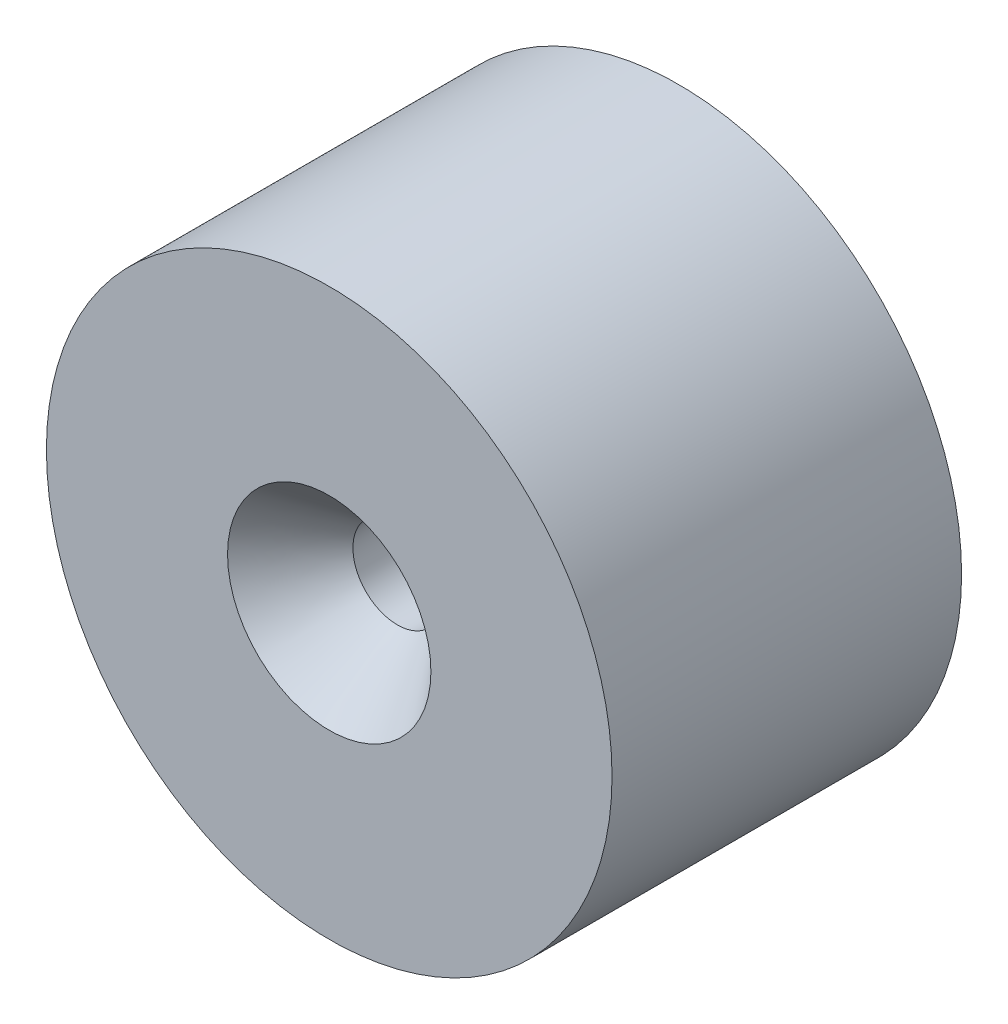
ISO-10303-21;
HEADER;
FILE_DESCRIPTION(('STEP AP214'),'2;1');
FILE_NAME('part.step','',(''),(''),'','','');
FILE_SCHEMA(('AUTOMOTIVE_DESIGN { 1 0 10303 214 1 1 1 1 }'));
ENDSEC;
DATA;
#1=APPLICATION_CONTEXT('core data for automotive mechanical design processes');
#2=APPLICATION_PROTOCOL_DEFINITION('international standard','automotive_design',2000,#1);
#3=PRODUCT_CONTEXT('',#1,'mechanical');
#4=PRODUCT('Part','Part','',(#3));
#5=PRODUCT_RELATED_PRODUCT_CATEGORY('part','',(#4));
#6=PRODUCT_DEFINITION_FORMATION('','',#4);
#7=PRODUCT_DEFINITION_CONTEXT('part definition',#1,'design');
#8=PRODUCT_DEFINITION('design','',#6,#7);
#9=PRODUCT_DEFINITION_SHAPE('','',#8);
#10=(LENGTH_UNIT() NAMED_UNIT(*) SI_UNIT(.MILLI.,.METRE.));
#11=(NAMED_UNIT(*) PLANE_ANGLE_UNIT() SI_UNIT($,.RADIAN.));
#12=(NAMED_UNIT(*) SI_UNIT($,.STERADIAN.) SOLID_ANGLE_UNIT());
#13=UNCERTAINTY_MEASURE_WITH_UNIT(LENGTH_MEASURE(1.E-05),#10,'distance_accuracy_value','');
#14=(GEOMETRIC_REPRESENTATION_CONTEXT(3) GLOBAL_UNCERTAINTY_ASSIGNED_CONTEXT((#13)) GLOBAL_UNIT_ASSIGNED_CONTEXT((#10,
#11,#12)) REPRESENTATION_CONTEXT('',''));
#15=CARTESIAN_POINT('',(0.,0.,0.));
#16=DIRECTION('',(0.,0.,1.));
#17=DIRECTION('',(1.,0.,0.));
#18=AXIS2_PLACEMENT_3D('',#15,#16,#17);
#19=CARTESIAN_POINT('',(0.,0.,11.));
#20=DIRECTION('',(0.,0.,1.));
#21=DIRECTION('',(1.,0.,0.));
#22=AXIS2_PLACEMENT_3D('',#19,#20,#21);
#23=PLANE('',#22);
#24=CARTESIAN_POINT('',(0.,0.,11.));
#25=DIRECTION('',(0.,0.,1.));
#26=DIRECTION('',(1.,0.,0.));
#27=AXIS2_PLACEMENT_3D('',#24,#25,#26);
#28=CIRCLE('',#27,3.2);
#29=CARTESIAN_POINT('',(3.2,0.,11.));
#30=VERTEX_POINT('',#29);
#31=EDGE_CURVE('E70',#30,#30,#28,.T.);
#32=ORIENTED_EDGE('',*,*,#31,.F.);
#33=EDGE_LOOP('',(#32));
#34=FACE_BOUND('',#33,.T.);
#35=CARTESIAN_POINT('',(0.,0.,11.));
#36=DIRECTION('',(0.,0.,1.));
#37=DIRECTION('',(1.,0.,0.));
#38=AXIS2_PLACEMENT_3D('',#35,#36,#37);
#39=CIRCLE('',#38,8.9);
#40=CARTESIAN_POINT('',(8.9,0.,11.));
#41=VERTEX_POINT('',#40);
#42=EDGE_CURVE('E11',#41,#41,#39,.T.);
#43=ORIENTED_EDGE('',*,*,#42,.T.);
#44=EDGE_LOOP('',(#43));
#45=FACE_BOUND('',#44,.T.);
#46=ADVANCED_FACE('F40',(#34,#45),#23,.T.);
#47=CARTESIAN_POINT('',(0.,0.,0.));
#48=DIRECTION('',(0.,0.,1.));
#49=DIRECTION('',(1.,0.,0.));
#50=AXIS2_PLACEMENT_3D('',#47,#48,#49);
#51=PLANE('',#50);
#52=CARTESIAN_POINT('',(0.,0.,0.));
#53=DIRECTION('',(0.,0.,1.));
#54=DIRECTION('',(1.,0.,0.));
#55=AXIS2_PLACEMENT_3D('',#52,#53,#54);
#56=CIRCLE('',#55,8.9);
#57=CARTESIAN_POINT('',(8.9,0.,0.));
#58=VERTEX_POINT('',#57);
#59=EDGE_CURVE('E44',#58,#58,#56,.T.);
#60=ORIENTED_EDGE('',*,*,#59,.F.);
#61=EDGE_LOOP('',(#60));
#62=FACE_BOUND('',#61,.T.);
#63=CARTESIAN_POINT('',(0.,0.,0.));
#64=DIRECTION('',(0.,0.,1.));
#65=DIRECTION('',(1.,0.,0.));
#66=AXIS2_PLACEMENT_3D('',#63,#64,#65);
#67=CIRCLE('',#66,1.4);
#68=CARTESIAN_POINT('',(1.4,0.,0.));
#69=VERTEX_POINT('',#68);
#70=EDGE_CURVE('E51',#69,#69,#67,.T.);
#71=ORIENTED_EDGE('',*,*,#70,.T.);
#72=EDGE_LOOP('',(#71));
#73=FACE_BOUND('',#72,.T.);
#74=ADVANCED_FACE('F77',(#62,#73),#51,.F.);
#75=CARTESIAN_POINT('',(0.,0.,11.));
#76=DIRECTION('',(0.,0.,-1.));
#77=DIRECTION('',(-1.,0.,0.));
#78=AXIS2_PLACEMENT_3D('',#75,#76,#77);
#79=CYLINDRICAL_SURFACE('',#78,8.9);
#80=ORIENTED_EDGE('',*,*,#42,.F.);
#81=EDGE_LOOP('',(#80));
#82=FACE_BOUND('',#81,.T.);
#83=ORIENTED_EDGE('',*,*,#59,.T.);
#84=EDGE_LOOP('',(#83));
#85=FACE_BOUND('',#84,.T.);
#86=ADVANCED_FACE('F42',(#82,#85),#79,.T.);
#87=CARTESIAN_POINT('',(0.,0.,11.));
#88=DIRECTION('',(0.,0.,-1.));
#89=DIRECTION('',(-1.,0.,0.));
#90=AXIS2_PLACEMENT_3D('',#87,#88,#89);
#91=CYLINDRICAL_SURFACE('',#90,1.4);
#92=CARTESIAN_POINT('',(0.,0.,8.85484353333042));
#93=DIRECTION('',(0.,0.,1.));
#94=DIRECTION('',(1.,0.,0.));
#95=AXIS2_PLACEMENT_3D('',#92,#93,#94);
#96=CIRCLE('',#95,1.4);
#97=CARTESIAN_POINT('',(1.4,0.,8.85484353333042));
#98=VERTEX_POINT('',#97);
#99=EDGE_CURVE('E65',#98,#98,#96,.T.);
#100=ORIENTED_EDGE('',*,*,#99,.T.);
#101=EDGE_LOOP('',(#100));
#102=FACE_BOUND('',#101,.T.);
#103=ORIENTED_EDGE('',*,*,#70,.F.);
#104=EDGE_LOOP('',(#103));
#105=FACE_BOUND('',#104,.T.);
#106=ADVANCED_FACE('F84',(#102,#105),#91,.F.);
#107=CARTESIAN_POINT('',(0.,0.,11.));
#108=DIRECTION('',(0.,0.,1.));
#109=DIRECTION('',(1.,0.,0.));
#110=AXIS2_PLACEMENT_3D('',#107,#108,#109);
#111=CONICAL_SURFACE('',#110,3.2,0.698131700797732);
#112=ORIENTED_EDGE('',*,*,#99,.F.);
#113=EDGE_LOOP('',(#112));
#114=FACE_BOUND('',#113,.T.);
#115=ORIENTED_EDGE('',*,*,#31,.T.);
#116=EDGE_LOOP('',(#115));
#117=FACE_BOUND('',#116,.T.);
#118=ADVANCED_FACE('F74',(#114,#117),#111,.F.);
#119=CLOSED_SHELL('',(#46,#74,#86,#106,#118));
#120=CARTESIAN_POINT('',(0.,0.,9.));
#121=DIRECTION('',(0.,0.,-1.));
#122=DIRECTION('',(-1.,0.,0.));
#123=AXIS2_PLACEMENT_3D('',#120,#121,#122);
#124=CYLINDRICAL_SURFACE('',#123,6.3);
#125=CARTESIAN_POINT('',(0.,0.,9.));
#126=DIRECTION('',(0.,0.,-1.));
#127=DIRECTION('',(-1.,0.,0.));
#128=AXIS2_PLACEMENT_3D('',#125,#126,#127);
#129=CIRCLE('',#128,6.3);
#130=CARTESIAN_POINT('',(-6.3,0.,9.));
#131=VERTEX_POINT('',#130);
#132=EDGE_CURVE('E55',#131,#131,#129,.T.);
#133=ORIENTED_EDGE('',*,*,#132,.F.);
#134=EDGE_LOOP('',(#133));
#135=FACE_BOUND('',#134,.T.);
#136=CARTESIAN_POINT('',(0.,0.,2.));
#137=DIRECTION('',(0.,0.,-1.));
#138=DIRECTION('',(-1.,0.,0.));
#139=AXIS2_PLACEMENT_3D('',#136,#137,#138);
#140=CIRCLE('',#139,6.3);
#141=CARTESIAN_POINT('',(-6.3,0.,2.));
#142=VERTEX_POINT('',#141);
#143=EDGE_CURVE('E56',#142,#142,#140,.T.);
#144=ORIENTED_EDGE('',*,*,#143,.T.);
#145=EDGE_LOOP('',(#144));
#146=FACE_BOUND('',#145,.T.);
#147=ADVANCED_FACE('F88',(#135,#146),#124,.F.);
#148=CARTESIAN_POINT('',(0.,0.,9.));
#149=DIRECTION('',(0.,0.,-1.));
#150=DIRECTION('',(-1.,0.,0.));
#151=AXIS2_PLACEMENT_3D('',#148,#149,#150);
#152=PLANE('',#151);
#153=CARTESIAN_POINT('',(0.,0.,9.));
#154=DIRECTION('',(0.,0.,-1.));
#155=DIRECTION('',(-1.,0.,0.));
#156=AXIS2_PLACEMENT_3D('',#153,#154,#155);
#157=CIRCLE('',#156,3.5);
#158=CARTESIAN_POINT('',(-3.5,0.,9.));
#159=VERTEX_POINT('',#158);
#160=EDGE_CURVE('E59',#159,#159,#157,.T.);
#161=ORIENTED_EDGE('',*,*,#160,.F.);
#162=EDGE_LOOP('',(#161));
#163=FACE_BOUND('',#162,.T.);
#164=ORIENTED_EDGE('',*,*,#132,.T.);
#165=EDGE_LOOP('',(#164));
#166=FACE_BOUND('',#165,.T.);
#167=ADVANCED_FACE('F91',(#163,#166),#152,.T.);
#168=CARTESIAN_POINT('',(0.,0.,2.));
#169=DIRECTION('',(0.,0.,-1.));
#170=DIRECTION('',(-1.,0.,0.));
#171=AXIS2_PLACEMENT_3D('',#168,#169,#170);
#172=PLANE('',#171);
#173=CARTESIAN_POINT('',(0.,0.,2.));
#174=DIRECTION('',(0.,0.,-1.));
#175=DIRECTION('',(-1.,0.,0.));
#176=AXIS2_PLACEMENT_3D('',#173,#174,#175);
#177=CIRCLE('',#176,3.5);
#178=CARTESIAN_POINT('',(-3.5,0.,2.));
#179=VERTEX_POINT('',#178);
#180=EDGE_CURVE('E62',#179,#179,#177,.T.);
#181=ORIENTED_EDGE('',*,*,#180,.T.);
#182=EDGE_LOOP('',(#181));
#183=FACE_BOUND('',#182,.T.);
#184=ORIENTED_EDGE('',*,*,#143,.F.);
#185=EDGE_LOOP('',(#184));
#186=FACE_BOUND('',#185,.T.);
#187=ADVANCED_FACE('F94',(#183,#186),#172,.F.);
#188=CARTESIAN_POINT('',(0.,0.,9.));
#189=DIRECTION('',(0.,0.,-1.));
#190=DIRECTION('',(-1.,0.,0.));
#191=AXIS2_PLACEMENT_3D('',#188,#189,#190);
#192=CYLINDRICAL_SURFACE('',#191,3.5);
#193=ORIENTED_EDGE('',*,*,#160,.T.);
#194=EDGE_LOOP('',(#193));
#195=FACE_BOUND('',#194,.T.);
#196=ORIENTED_EDGE('',*,*,#180,.F.);
#197=EDGE_LOOP('',(#196));
#198=FACE_BOUND('',#197,.T.);
#199=ADVANCED_FACE('F97',(#195,#198),#192,.T.);
#200=CLOSED_SHELL('',(#147,#167,#187,#199));
#201=ORIENTED_CLOSED_SHELL('',*,#200,.T.);
#202=BREP_WITH_VOIDS('B2',#119,(#201));
#203=ADVANCED_BREP_SHAPE_REPRESENTATION('',(#18,#202),#14);
#204=SHAPE_DEFINITION_REPRESENTATION(#9,#203);
ENDSEC;
END-ISO-10303-21;
